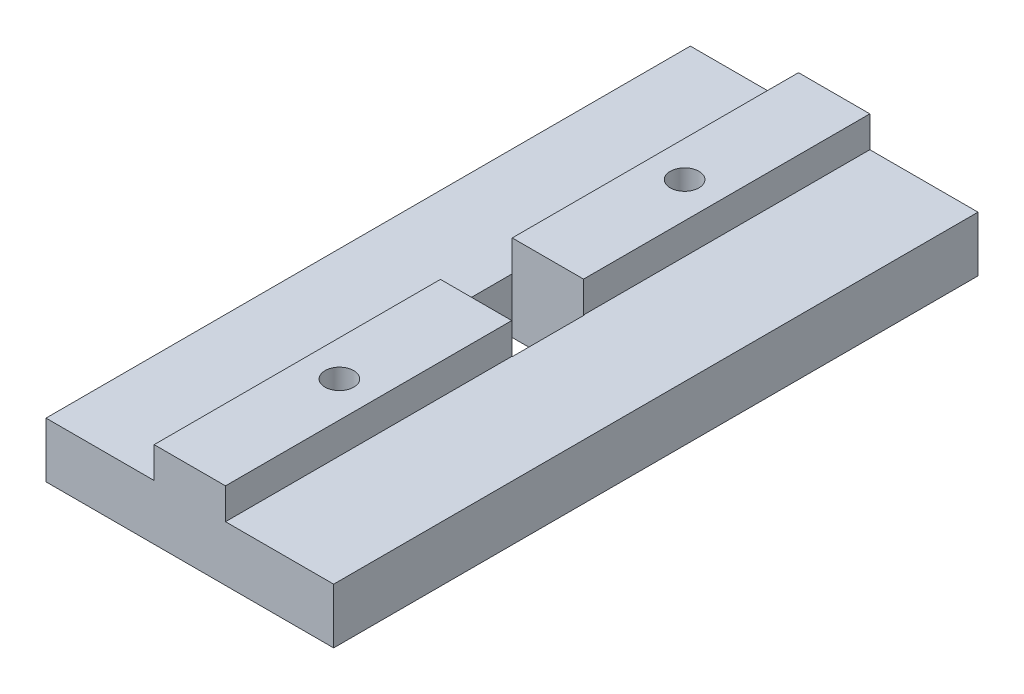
ISO-10303-21;
HEADER;
FILE_DESCRIPTION(('STEP AP214'),'2;1');
FILE_NAME('part.step','',(''),(''),'','','');
FILE_SCHEMA(('AUTOMOTIVE_DESIGN { 1 0 10303 214 1 1 1 1 }'));
ENDSEC;
DATA;
#1=APPLICATION_CONTEXT('core data for automotive mechanical design processes');
#2=APPLICATION_PROTOCOL_DEFINITION('international standard','automotive_design',2000,#1);
#3=PRODUCT_CONTEXT('',#1,'mechanical');
#4=PRODUCT('Part','Part','',(#3));
#5=PRODUCT_RELATED_PRODUCT_CATEGORY('part','',(#4));
#6=PRODUCT_DEFINITION_FORMATION('','',#4);
#7=PRODUCT_DEFINITION_CONTEXT('part definition',#1,'design');
#8=PRODUCT_DEFINITION('design','',#6,#7);
#9=PRODUCT_DEFINITION_SHAPE('','',#8);
#10=(LENGTH_UNIT() NAMED_UNIT(*) SI_UNIT(.MILLI.,.METRE.));
#11=(NAMED_UNIT(*) PLANE_ANGLE_UNIT() SI_UNIT($,.RADIAN.));
#12=(NAMED_UNIT(*) SI_UNIT($,.STERADIAN.) SOLID_ANGLE_UNIT());
#13=UNCERTAINTY_MEASURE_WITH_UNIT(LENGTH_MEASURE(1.E-05),#10,'distance_accuracy_value','');
#14=(GEOMETRIC_REPRESENTATION_CONTEXT(3) GLOBAL_UNCERTAINTY_ASSIGNED_CONTEXT((#13)) GLOBAL_UNIT_ASSIGNED_CONTEXT((#10,
#11,#12)) REPRESENTATION_CONTEXT('',''));
#15=CARTESIAN_POINT('',(0.,0.,0.));
#16=DIRECTION('',(0.,0.,1.));
#17=DIRECTION('',(1.,0.,0.));
#18=AXIS2_PLACEMENT_3D('',#15,#16,#17);
#19=CARTESIAN_POINT('',(-7.07558553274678,-11.3128787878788,71.12));
#20=DIRECTION('',(-1.,0.,0.));
#21=DIRECTION('',(0.,-1.,0.));
#22=AXIS2_PLACEMENT_3D('',#19,#20,#21);
#23=PLANE('',#22);
#24=DIRECTION('',(0.,0.,-1.));
#25=VECTOR('',#24,1.);
#26=CARTESIAN_POINT('',(-7.07558553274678,-11.3128787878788,71.12));
#27=LINE('',#26,#25);
#28=CARTESIAN_POINT('',(-7.07558553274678,-11.3128787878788,31.5976));
#29=VERTEX_POINT('',#28);
#30=CARTESIAN_POINT('',(-7.07558553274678,-11.3128787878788,0.));
#31=VERTEX_POINT('',#30);
#32=EDGE_CURVE('E230',#29,#31,#27,.T.);
#33=ORIENTED_EDGE('',*,*,#32,.F.);
#34=DIRECTION('',(0.,-1.,0.));
#35=VECTOR('',#34,1.);
#36=CARTESIAN_POINT('',(-7.07558553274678,-11.3128787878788,31.5976));
#37=LINE('',#36,#35);
#38=CARTESIAN_POINT('',(-7.07558553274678,-14.7418787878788,31.5976));
#39=VERTEX_POINT('',#38);
#40=EDGE_CURVE('E169',#29,#39,#37,.T.);
#41=ORIENTED_EDGE('',*,*,#40,.T.);
#42=DIRECTION('',(0.,0.,-1.));
#43=VECTOR('',#42,1.);
#44=CARTESIAN_POINT('',(-7.07558553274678,-14.7418787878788,71.12));
#45=LINE('',#44,#43);
#46=CARTESIAN_POINT('',(-7.07558553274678,-14.7418787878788,0.));
#47=VERTEX_POINT('',#46);
#48=EDGE_CURVE('E234',#39,#47,#45,.T.);
#49=ORIENTED_EDGE('',*,*,#48,.T.);
#50=DIRECTION('',(0.,1.,0.));
#51=VECTOR('',#50,1.);
#52=CARTESIAN_POINT('',(-7.07558553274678,-11.3128787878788,0.));
#53=LINE('',#52,#51);
#54=EDGE_CURVE('E210',#47,#31,#53,.T.);
#55=ORIENTED_EDGE('',*,*,#54,.T.);
#56=EDGE_LOOP('',(#33,#41,#49,#55));
#57=FACE_BOUND('',#56,.T.);
#58=ADVANCED_FACE('F17',(#57),#23,.F.);
#59=CARTESIAN_POINT('',(-14.9495855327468,-11.3128787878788,71.12));
#60=DIRECTION('',(0.,-1.,0.));
#61=DIRECTION('',(0.,0.,-1.));
#62=AXIS2_PLACEMENT_3D('',#59,#60,#61);
#63=PLANE('',#62);
#64=CARTESIAN_POINT('',(-11.0125855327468,-11.3128787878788,16.51));
#65=DIRECTION('',(0.,1.,0.));
#66=DIRECTION('',(0.,0.,1.));
#67=AXIS2_PLACEMENT_3D('',#64,#65,#66);
#68=CIRCLE('',#67,1.5875);
#69=CARTESIAN_POINT('',(-11.0125855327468,-11.3128787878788,18.0975));
#70=VERTEX_POINT('',#69);
#71=EDGE_CURVE('E150',#70,#70,#68,.T.);
#72=ORIENTED_EDGE('',*,*,#71,.F.);
#73=EDGE_LOOP('',(#72));
#74=FACE_BOUND('',#73,.T.);
#75=DIRECTION('',(0.,0.,-1.));
#76=VECTOR('',#75,1.);
#77=CARTESIAN_POINT('',(-14.9495855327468,-11.3128787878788,71.12));
#78=LINE('',#77,#76);
#79=CARTESIAN_POINT('',(-14.9495855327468,-11.3128787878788,31.5976));
#80=VERTEX_POINT('',#79);
#81=CARTESIAN_POINT('',(-14.9495855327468,-11.3128787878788,0.));
#82=VERTEX_POINT('',#81);
#83=EDGE_CURVE('E226',#80,#82,#78,.T.);
#84=ORIENTED_EDGE('',*,*,#83,.F.);
#85=DIRECTION('',(-1.,0.,0.));
#86=VECTOR('',#85,1.);
#87=CARTESIAN_POINT('',(-14.9495855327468,-11.3128787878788,31.5976));
#88=LINE('',#87,#86);
#89=EDGE_CURVE('E145',#29,#80,#88,.T.);
#90=ORIENTED_EDGE('',*,*,#89,.F.);
#91=ORIENTED_EDGE('',*,*,#32,.T.);
#92=DIRECTION('',(-1.,0.,0.));
#93=VECTOR('',#92,1.);
#94=CARTESIAN_POINT('',(-14.9495855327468,-11.3128787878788,0.));
#95=LINE('',#94,#93);
#96=EDGE_CURVE('E213',#31,#82,#95,.T.);
#97=ORIENTED_EDGE('',*,*,#96,.T.);
#98=EDGE_LOOP('',(#84,#90,#91,#97));
#99=FACE_BOUND('',#98,.T.);
#100=ADVANCED_FACE('F283',(#74,#99),#63,.F.);
#101=CARTESIAN_POINT('',(-14.9495855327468,-14.7418787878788,71.12));
#102=DIRECTION('',(1.,0.,0.));
#103=DIRECTION('',(0.,1.,0.));
#104=AXIS2_PLACEMENT_3D('',#101,#102,#103);
#105=PLANE('',#104);
#106=DIRECTION('',(0.,0.,-1.));
#107=VECTOR('',#106,1.);
#108=CARTESIAN_POINT('',(-14.9495855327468,-14.7418787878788,71.12));
#109=LINE('',#108,#107);
#110=CARTESIAN_POINT('',(-14.9495855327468,-14.7418787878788,31.5976));
#111=VERTEX_POINT('',#110);
#112=CARTESIAN_POINT('',(-14.9495855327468,-14.7418787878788,0.));
#113=VERTEX_POINT('',#112);
#114=EDGE_CURVE('E222',#111,#113,#109,.T.);
#115=ORIENTED_EDGE('',*,*,#114,.F.);
#116=DIRECTION('',(0.,1.,0.));
#117=VECTOR('',#116,1.);
#118=CARTESIAN_POINT('',(-14.9495855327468,-20.8378787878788,31.5976));
#119=LINE('',#118,#117);
#120=EDGE_CURVE('E159',#111,#80,#119,.T.);
#121=ORIENTED_EDGE('',*,*,#120,.T.);
#122=ORIENTED_EDGE('',*,*,#83,.T.);
#123=DIRECTION('',(0.,-1.,0.));
#124=VECTOR('',#123,1.);
#125=CARTESIAN_POINT('',(-14.9495855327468,-14.7418787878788,0.));
#126=LINE('',#125,#124);
#127=EDGE_CURVE('E216',#82,#113,#126,.T.);
#128=ORIENTED_EDGE('',*,*,#127,.T.);
#129=EDGE_LOOP('',(#115,#121,#122,#128));
#130=FACE_BOUND('',#129,.T.);
#131=ADVANCED_FACE('F279',(#130),#105,.F.);
#132=CARTESIAN_POINT('',(-26.8875855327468,-14.7418787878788,71.12));
#133=DIRECTION('',(1.,0.,0.));
#134=DIRECTION('',(0.,0.,-1.));
#135=AXIS2_PLACEMENT_3D('',#132,#133,#134);
#136=PLANE('',#135);
#137=DIRECTION('',(0.,-1.,0.));
#138=VECTOR('',#137,1.);
#139=CARTESIAN_POINT('',(-26.8875855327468,-14.7418787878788,0.));
#140=LINE('',#139,#138);
#141=CARTESIAN_POINT('',(-26.8875855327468,-14.7418787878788,0.));
#142=VERTEX_POINT('',#141);
#143=CARTESIAN_POINT('',(-26.8875855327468,-20.8378787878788,0.));
#144=VERTEX_POINT('',#143);
#145=EDGE_CURVE('E179',#142,#144,#140,.T.);
#146=ORIENTED_EDGE('',*,*,#145,.T.);
#147=DIRECTION('',(0.,0.,-1.));
#148=VECTOR('',#147,1.);
#149=CARTESIAN_POINT('',(-26.8875855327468,-20.8378787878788,71.12));
#150=LINE('',#149,#148);
#151=CARTESIAN_POINT('',(-26.8875855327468,-20.8378787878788,71.12));
#152=VERTEX_POINT('',#151);
#153=EDGE_CURVE('E25',#152,#144,#150,.T.);
#154=ORIENTED_EDGE('',*,*,#153,.F.);
#155=DIRECTION('',(0.,-1.,0.));
#156=VECTOR('',#155,1.);
#157=CARTESIAN_POINT('',(-26.8875855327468,-14.7418787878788,71.12));
#158=LINE('',#157,#156);
#159=CARTESIAN_POINT('',(-26.8875855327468,-14.7418787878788,71.12));
#160=VERTEX_POINT('',#159);
#161=EDGE_CURVE('E182',#160,#152,#158,.T.);
#162=ORIENTED_EDGE('',*,*,#161,.F.);
#163=DIRECTION('',(0.,0.,-1.));
#164=VECTOR('',#163,1.);
#165=CARTESIAN_POINT('',(-26.8875855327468,-14.7418787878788,71.12));
#166=LINE('',#165,#164);
#167=EDGE_CURVE('E200',#160,#142,#166,.T.);
#168=ORIENTED_EDGE('',*,*,#167,.T.);
#169=EDGE_LOOP('',(#146,#154,#162,#168));
#170=FACE_BOUND('',#169,.T.);
#171=ADVANCED_FACE('F19',(#170),#136,.F.);
#172=CARTESIAN_POINT('',(-26.8875855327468,-20.8378787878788,71.12));
#173=DIRECTION('',(0.,1.,0.));
#174=DIRECTION('',(0.,0.,1.));
#175=AXIS2_PLACEMENT_3D('',#172,#173,#174);
#176=PLANE('',#175);
#177=CARTESIAN_POINT('',(-11.0125855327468,-20.8378787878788,16.51));
#178=DIRECTION('',(0.,1.,0.));
#179=DIRECTION('',(0.,0.,1.));
#180=AXIS2_PLACEMENT_3D('',#177,#178,#179);
#181=CIRCLE('',#180,1.5875);
#182=CARTESIAN_POINT('',(-11.0125855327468,-20.8378787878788,18.0975));
#183=VERTEX_POINT('',#182);
#184=EDGE_CURVE('E155',#183,#183,#181,.T.);
#185=ORIENTED_EDGE('',*,*,#184,.T.);
#186=EDGE_LOOP('',(#185));
#187=FACE_BOUND('',#186,.T.);
#188=DIRECTION('',(-1.,0.,0.));
#189=VECTOR('',#188,1.);
#190=CARTESIAN_POINT('',(-14.9495855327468,-20.8378787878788,31.5976));
#191=LINE('',#190,#189);
#192=CARTESIAN_POINT('',(-7.02478553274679,-20.8378787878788,31.5976));
#193=VERTEX_POINT('',#192);
#194=CARTESIAN_POINT('',(-14.9495855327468,-20.8378787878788,31.5976));
#195=VERTEX_POINT('',#194);
#196=EDGE_CURVE('E144',#193,#195,#191,.T.);
#197=ORIENTED_EDGE('',*,*,#196,.T.);
#198=DIRECTION('',(0.,0.,1.));
#199=VECTOR('',#198,1.);
#200=CARTESIAN_POINT('',(-14.9495855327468,-20.8378787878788,31.5976));
#201=LINE('',#200,#199);
#202=CARTESIAN_POINT('',(-14.9495855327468,-20.8378787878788,39.5224));
#203=VERTEX_POINT('',#202);
#204=EDGE_CURVE('E127',#195,#203,#201,.T.);
#205=ORIENTED_EDGE('',*,*,#204,.T.);
#206=DIRECTION('',(1.,0.,0.));
#207=VECTOR('',#206,1.);
#208=CARTESIAN_POINT('',(-14.9495855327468,-20.8378787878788,39.5224));
#209=LINE('',#208,#207);
#210=CARTESIAN_POINT('',(-7.02478553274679,-20.8378787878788,39.5224));
#211=VERTEX_POINT('',#210);
#212=EDGE_CURVE('E137',#203,#211,#209,.T.);
#213=ORIENTED_EDGE('',*,*,#212,.T.);
#214=DIRECTION('',(0.,0.,-1.));
#215=VECTOR('',#214,1.);
#216=CARTESIAN_POINT('',(-7.02478553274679,-20.8378787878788,31.5976));
#217=LINE('',#216,#215);
#218=EDGE_CURVE('E32',#211,#193,#217,.T.);
#219=ORIENTED_EDGE('',*,*,#218,.T.);
#220=EDGE_LOOP('',(#197,#205,#213,#219));
#221=FACE_BOUND('',#220,.T.);
#222=CARTESIAN_POINT('',(-11.0125855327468,-20.8378787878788,54.61));
#223=DIRECTION('',(0.,1.,0.));
#224=DIRECTION('',(0.,0.,1.));
#225=AXIS2_PLACEMENT_3D('',#222,#223,#224);
#226=CIRCLE('',#225,1.5875);
#227=CARTESIAN_POINT('',(-11.0125855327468,-20.8378787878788,56.1975));
#228=VERTEX_POINT('',#227);
#229=EDGE_CURVE('E176',#228,#228,#226,.T.);
#230=ORIENTED_EDGE('',*,*,#229,.T.);
#231=EDGE_LOOP('',(#230));
#232=FACE_BOUND('',#231,.T.);
#233=DIRECTION('',(1.,0.,0.));
#234=VECTOR('',#233,1.);
#235=CARTESIAN_POINT('',(-26.8875855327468,-20.8378787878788,0.));
#236=LINE('',#235,#234);
#237=CARTESIAN_POINT('',(4.86241446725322,-20.8378787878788,0.));
#238=VERTEX_POINT('',#237);
#239=EDGE_CURVE('E203',#144,#238,#236,.T.);
#240=ORIENTED_EDGE('',*,*,#239,.T.);
#241=DIRECTION('',(0.,0.,-1.));
#242=VECTOR('',#241,1.);
#243=CARTESIAN_POINT('',(4.86241446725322,-20.8378787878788,71.12));
#244=LINE('',#243,#242);
#245=CARTESIAN_POINT('',(4.86241446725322,-20.8378787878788,71.12));
#246=VERTEX_POINT('',#245);
#247=EDGE_CURVE('E241',#246,#238,#244,.T.);
#248=ORIENTED_EDGE('',*,*,#247,.F.);
#249=DIRECTION('',(1.,0.,0.));
#250=VECTOR('',#249,1.);
#251=CARTESIAN_POINT('',(-26.8875855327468,-20.8378787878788,71.12));
#252=LINE('',#251,#250);
#253=EDGE_CURVE('E185',#152,#246,#252,.T.);
#254=ORIENTED_EDGE('',*,*,#253,.F.);
#255=ORIENTED_EDGE('',*,*,#153,.T.);
#256=EDGE_LOOP('',(#240,#248,#254,#255));
#257=FACE_BOUND('',#256,.T.);
#258=ADVANCED_FACE('F141',(#187,#221,#232,#257),#176,.F.);
#259=CARTESIAN_POINT('',(4.86241446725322,-14.7418787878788,71.12));
#260=DIRECTION('',(-1.,0.,0.));
#261=DIRECTION('',(0.,0.,1.));
#262=AXIS2_PLACEMENT_3D('',#259,#260,#261);
#263=PLANE('',#262);
#264=DIRECTION('',(0.,1.,0.));
#265=VECTOR('',#264,1.);
#266=CARTESIAN_POINT('',(4.86241446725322,-14.7418787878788,0.));
#267=LINE('',#266,#265);
#268=CARTESIAN_POINT('',(4.86241446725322,-14.7418787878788,0.));
#269=VERTEX_POINT('',#268);
#270=EDGE_CURVE('E205',#238,#269,#267,.T.);
#271=ORIENTED_EDGE('',*,*,#270,.T.);
#272=DIRECTION('',(0.,0.,-1.));
#273=VECTOR('',#272,1.);
#274=CARTESIAN_POINT('',(4.86241446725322,-14.7418787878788,71.12));
#275=LINE('',#274,#273);
#276=CARTESIAN_POINT('',(4.86241446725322,-14.7418787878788,71.12));
#277=VERTEX_POINT('',#276);
#278=EDGE_CURVE('E238',#277,#269,#275,.T.);
#279=ORIENTED_EDGE('',*,*,#278,.F.);
#280=DIRECTION('',(0.,1.,0.));
#281=VECTOR('',#280,1.);
#282=CARTESIAN_POINT('',(4.86241446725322,-14.7418787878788,71.12));
#283=LINE('',#282,#281);
#284=EDGE_CURVE('E188',#246,#277,#283,.T.);
#285=ORIENTED_EDGE('',*,*,#284,.F.);
#286=ORIENTED_EDGE('',*,*,#247,.T.);
#287=EDGE_LOOP('',(#271,#279,#285,#286));
#288=FACE_BOUND('',#287,.T.);
#289=ADVANCED_FACE('F260',(#288),#263,.F.);
#290=CARTESIAN_POINT('',(-7.07558553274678,-14.7418787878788,71.12));
#291=DIRECTION('',(0.,-1.,0.));
#292=DIRECTION('',(0.,0.,-1.));
#293=AXIS2_PLACEMENT_3D('',#290,#291,#292);
#294=PLANE('',#293);
#295=ORIENTED_EDGE('',*,*,#48,.F.);
#296=DIRECTION('',(1.,0.,0.));
#297=VECTOR('',#296,1.);
#298=CARTESIAN_POINT('',(-7.07558553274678,-14.7418787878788,31.5976));
#299=LINE('',#298,#297);
#300=CARTESIAN_POINT('',(-7.02478553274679,-14.7418787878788,31.5976));
#301=VERTEX_POINT('',#300);
#302=EDGE_CURVE('E172',#39,#301,#299,.T.);
#303=ORIENTED_EDGE('',*,*,#302,.T.);
#304=DIRECTION('',(0.,0.,1.));
#305=VECTOR('',#304,1.);
#306=CARTESIAN_POINT('',(-7.02478553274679,-14.7418787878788,71.12));
#307=LINE('',#306,#305);
#308=CARTESIAN_POINT('',(-7.02478553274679,-14.7418787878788,39.5224));
#309=VERTEX_POINT('',#308);
#310=EDGE_CURVE('E11',#301,#309,#307,.T.);
#311=ORIENTED_EDGE('',*,*,#310,.T.);
#312=DIRECTION('',(-1.,0.,0.));
#313=VECTOR('',#312,1.);
#314=CARTESIAN_POINT('',(-7.07558553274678,-14.7418787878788,39.5224));
#315=LINE('',#314,#313);
#316=CARTESIAN_POINT('',(-7.07558553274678,-14.7418787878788,39.5224));
#317=VERTEX_POINT('',#316);
#318=EDGE_CURVE('E166',#309,#317,#315,.T.);
#319=ORIENTED_EDGE('',*,*,#318,.T.);
#320=CARTESIAN_POINT('',(-7.07558553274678,-14.7418787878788,71.12));
#321=VERTEX_POINT('',#320);
#322=EDGE_CURVE('E235',#321,#317,#45,.T.);
#323=ORIENTED_EDGE('',*,*,#322,.F.);
#324=DIRECTION('',(-1.,0.,0.));
#325=VECTOR('',#324,1.);
#326=CARTESIAN_POINT('',(-7.07558553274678,-14.7418787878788,71.12));
#327=LINE('',#326,#325);
#328=EDGE_CURVE('E190',#277,#321,#327,.T.);
#329=ORIENTED_EDGE('',*,*,#328,.F.);
#330=ORIENTED_EDGE('',*,*,#278,.T.);
#331=DIRECTION('',(-1.,0.,0.));
#332=VECTOR('',#331,1.);
#333=CARTESIAN_POINT('',(-7.07558553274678,-14.7418787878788,0.));
#334=LINE('',#333,#332);
#335=EDGE_CURVE('E207',#269,#47,#334,.T.);
#336=ORIENTED_EDGE('',*,*,#335,.T.);
#337=EDGE_LOOP('',(#295,#303,#311,#319,#323,#329,#330,#336));
#338=FACE_BOUND('',#337,.T.);
#339=ADVANCED_FACE('F265',(#338),#294,.F.);
#340=ORIENTED_EDGE('',*,*,#322,.T.);
#341=DIRECTION('',(0.,1.,0.));
#342=VECTOR('',#341,1.);
#343=CARTESIAN_POINT('',(-7.07558553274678,-11.3128787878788,39.5224));
#344=LINE('',#343,#342);
#345=CARTESIAN_POINT('',(-7.07558553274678,-11.3128787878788,39.5224));
#346=VERTEX_POINT('',#345);
#347=EDGE_CURVE('E158',#317,#346,#344,.T.);
#348=ORIENTED_EDGE('',*,*,#347,.T.);
#349=CARTESIAN_POINT('',(-7.07558553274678,-11.3128787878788,71.12));
#350=VERTEX_POINT('',#349);
#351=EDGE_CURVE('E231',#350,#346,#27,.T.);
#352=ORIENTED_EDGE('',*,*,#351,.F.);
#353=DIRECTION('',(0.,1.,0.));
#354=VECTOR('',#353,1.);
#355=CARTESIAN_POINT('',(-7.07558553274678,-11.3128787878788,71.12));
#356=LINE('',#355,#354);
#357=EDGE_CURVE('E192',#321,#350,#356,.T.);
#358=ORIENTED_EDGE('',*,*,#357,.F.);
#359=EDGE_LOOP('',(#340,#348,#352,#358));
#360=FACE_BOUND('',#359,.T.);
#361=ADVANCED_FACE('F305',(#360),#23,.F.);
#362=CARTESIAN_POINT('',(-11.0125855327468,-11.3128787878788,54.61));
#363=DIRECTION('',(0.,1.,0.));
#364=DIRECTION('',(0.,0.,1.));
#365=AXIS2_PLACEMENT_3D('',#362,#363,#364);
#366=CIRCLE('',#365,1.5875);
#367=CARTESIAN_POINT('',(-11.0125855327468,-11.3128787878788,56.1975));
#368=VERTEX_POINT('',#367);
#369=EDGE_CURVE('E175',#368,#368,#366,.T.);
#370=ORIENTED_EDGE('',*,*,#369,.F.);
#371=EDGE_LOOP('',(#370));
#372=FACE_BOUND('',#371,.T.);
#373=ORIENTED_EDGE('',*,*,#351,.T.);
#374=DIRECTION('',(1.,0.,0.));
#375=VECTOR('',#374,1.);
#376=CARTESIAN_POINT('',(-14.9495855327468,-11.3128787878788,39.5224));
#377=LINE('',#376,#375);
#378=CARTESIAN_POINT('',(-14.9495855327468,-11.3128787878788,39.5224));
#379=VERTEX_POINT('',#378);
#380=EDGE_CURVE('E147',#379,#346,#377,.T.);
#381=ORIENTED_EDGE('',*,*,#380,.F.);
#382=CARTESIAN_POINT('',(-14.9495855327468,-11.3128787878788,71.12));
#383=VERTEX_POINT('',#382);
#384=EDGE_CURVE('E227',#383,#379,#78,.T.);
#385=ORIENTED_EDGE('',*,*,#384,.F.);
#386=DIRECTION('',(-1.,0.,0.));
#387=VECTOR('',#386,1.);
#388=CARTESIAN_POINT('',(-14.9495855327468,-11.3128787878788,71.12));
#389=LINE('',#388,#387);
#390=EDGE_CURVE('E194',#350,#383,#389,.T.);
#391=ORIENTED_EDGE('',*,*,#390,.F.);
#392=EDGE_LOOP('',(#373,#381,#385,#391));
#393=FACE_BOUND('',#392,.T.);
#394=ADVANCED_FACE('F312',(#372,#393),#63,.F.);
#395=ORIENTED_EDGE('',*,*,#384,.T.);
#396=DIRECTION('',(0.,1.,0.));
#397=VECTOR('',#396,1.);
#398=CARTESIAN_POINT('',(-14.9495855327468,-20.8378787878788,39.5224));
#399=LINE('',#398,#397);
#400=CARTESIAN_POINT('',(-14.9495855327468,-14.7418787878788,39.5224));
#401=VERTEX_POINT('',#400);
#402=EDGE_CURVE('E134',#401,#379,#399,.T.);
#403=ORIENTED_EDGE('',*,*,#402,.F.);
#404=CARTESIAN_POINT('',(-14.9495855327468,-14.7418787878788,71.12));
#405=VERTEX_POINT('',#404);
#406=EDGE_CURVE('E223',#405,#401,#109,.T.);
#407=ORIENTED_EDGE('',*,*,#406,.F.);
#408=DIRECTION('',(0.,-1.,0.));
#409=VECTOR('',#408,1.);
#410=CARTESIAN_POINT('',(-14.9495855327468,-14.7418787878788,71.12));
#411=LINE('',#410,#409);
#412=EDGE_CURVE('E196',#383,#405,#411,.T.);
#413=ORIENTED_EDGE('',*,*,#412,.F.);
#414=EDGE_LOOP('',(#395,#403,#407,#413));
#415=FACE_BOUND('',#414,.T.);
#416=ADVANCED_FACE('F321',(#415),#105,.F.);
#417=CARTESIAN_POINT('',(-26.8875855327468,-14.7418787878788,71.12));
#418=DIRECTION('',(0.,-1.,0.));
#419=DIRECTION('',(0.,0.,-1.));
#420=AXIS2_PLACEMENT_3D('',#417,#418,#419);
#421=PLANE('',#420);
#422=DIRECTION('',(-1.,0.,0.));
#423=VECTOR('',#422,1.);
#424=CARTESIAN_POINT('',(-26.8875855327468,-14.7418787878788,0.));
#425=LINE('',#424,#423);
#426=EDGE_CURVE('E186',#113,#142,#425,.T.);
#427=ORIENTED_EDGE('',*,*,#426,.T.);
#428=ORIENTED_EDGE('',*,*,#167,.F.);
#429=DIRECTION('',(-1.,0.,0.));
#430=VECTOR('',#429,1.);
#431=CARTESIAN_POINT('',(-26.8875855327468,-14.7418787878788,71.12));
#432=LINE('',#431,#430);
#433=EDGE_CURVE('E198',#405,#160,#432,.T.);
#434=ORIENTED_EDGE('',*,*,#433,.F.);
#435=ORIENTED_EDGE('',*,*,#406,.T.);
#436=EDGE_CURVE('E130',#401,#111,#109,.T.);
#437=ORIENTED_EDGE('',*,*,#436,.T.);
#438=ORIENTED_EDGE('',*,*,#114,.T.);
#439=EDGE_LOOP('',(#427,#428,#434,#435,#437,#438));
#440=FACE_BOUND('',#439,.T.);
#441=ADVANCED_FACE('F275',(#440),#421,.F.);
#442=CARTESIAN_POINT('',(-26.8875855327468,-20.8378787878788,71.12));
#443=DIRECTION('',(0.,0.,1.));
#444=DIRECTION('',(1.,0.,0.));
#445=AXIS2_PLACEMENT_3D('',#442,#443,#444);
#446=PLANE('',#445);
#447=ORIENTED_EDGE('',*,*,#161,.T.);
#448=ORIENTED_EDGE('',*,*,#253,.T.);
#449=ORIENTED_EDGE('',*,*,#284,.T.);
#450=ORIENTED_EDGE('',*,*,#328,.T.);
#451=ORIENTED_EDGE('',*,*,#357,.T.);
#452=ORIENTED_EDGE('',*,*,#390,.T.);
#453=ORIENTED_EDGE('',*,*,#412,.T.);
#454=ORIENTED_EDGE('',*,*,#433,.T.);
#455=EDGE_LOOP('',(#447,#448,#449,#450,#451,#452,#453,#454));
#456=FACE_BOUND('',#455,.T.);
#457=ADVANCED_FACE('F269',(#456),#446,.T.);
#458=CARTESIAN_POINT('',(-26.8875855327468,-20.8378787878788,0.));
#459=DIRECTION('',(0.,0.,1.));
#460=DIRECTION('',(1.,0.,0.));
#461=AXIS2_PLACEMENT_3D('',#458,#459,#460);
#462=PLANE('',#461);
#463=ORIENTED_EDGE('',*,*,#145,.F.);
#464=ORIENTED_EDGE('',*,*,#426,.F.);
#465=ORIENTED_EDGE('',*,*,#127,.F.);
#466=ORIENTED_EDGE('',*,*,#96,.F.);
#467=ORIENTED_EDGE('',*,*,#54,.F.);
#468=ORIENTED_EDGE('',*,*,#335,.F.);
#469=ORIENTED_EDGE('',*,*,#270,.F.);
#470=ORIENTED_EDGE('',*,*,#239,.F.);
#471=EDGE_LOOP('',(#463,#464,#465,#466,#467,#468,#469,#470));
#472=FACE_BOUND('',#471,.T.);
#473=ADVANCED_FACE('F253',(#472),#462,.F.);
#474=CARTESIAN_POINT('',(-11.0125855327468,-20.8378787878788,54.61));
#475=DIRECTION('',(0.,1.,0.));
#476=DIRECTION('',(0.,0.,1.));
#477=AXIS2_PLACEMENT_3D('',#474,#475,#476);
#478=CYLINDRICAL_SURFACE('',#477,1.5875);
#479=ORIENTED_EDGE('',*,*,#229,.F.);
#480=EDGE_LOOP('',(#479));
#481=FACE_BOUND('',#480,.T.);
#482=ORIENTED_EDGE('',*,*,#369,.T.);
#483=EDGE_LOOP('',(#482));
#484=FACE_BOUND('',#483,.T.);
#485=ADVANCED_FACE('F291',(#481,#484),#478,.F.);
#486=CARTESIAN_POINT('',(-7.02478553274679,-20.8378787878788,31.5976));
#487=DIRECTION('',(1.,0.,0.));
#488=DIRECTION('',(0.,0.,-1.));
#489=AXIS2_PLACEMENT_3D('',#486,#487,#488);
#490=PLANE('',#489);
#491=DIRECTION('',(0.,1.,0.));
#492=VECTOR('',#491,1.);
#493=CARTESIAN_POINT('',(-7.02478553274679,-20.8378787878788,31.5976));
#494=LINE('',#493,#492);
#495=EDGE_CURVE('E160',#193,#301,#494,.T.);
#496=ORIENTED_EDGE('',*,*,#495,.F.);
#497=ORIENTED_EDGE('',*,*,#218,.F.);
#498=DIRECTION('',(0.,1.,0.));
#499=VECTOR('',#498,1.);
#500=CARTESIAN_POINT('',(-7.02478553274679,-20.8378787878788,39.5224));
#501=LINE('',#500,#499);
#502=EDGE_CURVE('E133',#211,#309,#501,.T.);
#503=ORIENTED_EDGE('',*,*,#502,.T.);
#504=ORIENTED_EDGE('',*,*,#310,.F.);
#505=EDGE_LOOP('',(#496,#497,#503,#504));
#506=FACE_BOUND('',#505,.T.);
#507=ADVANCED_FACE('F289',(#506),#490,.F.);
#508=CARTESIAN_POINT('',(-14.9495855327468,-20.8378787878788,31.5976));
#509=DIRECTION('',(0.,0.,-1.));
#510=DIRECTION('',(-1.,0.,0.));
#511=AXIS2_PLACEMENT_3D('',#508,#509,#510);
#512=PLANE('',#511);
#513=ORIENTED_EDGE('',*,*,#40,.F.);
#514=ORIENTED_EDGE('',*,*,#89,.T.);
#515=ORIENTED_EDGE('',*,*,#120,.F.);
#516=EDGE_CURVE('E40',#195,#111,#119,.T.);
#517=ORIENTED_EDGE('',*,*,#516,.F.);
#518=ORIENTED_EDGE('',*,*,#196,.F.);
#519=ORIENTED_EDGE('',*,*,#495,.T.);
#520=ORIENTED_EDGE('',*,*,#302,.F.);
#521=EDGE_LOOP('',(#513,#514,#515,#517,#518,#519,#520));
#522=FACE_BOUND('',#521,.T.);
#523=ADVANCED_FACE('F288',(#522),#512,.F.);
#524=CARTESIAN_POINT('',(-14.9495855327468,-20.8378787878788,39.5224));
#525=DIRECTION('',(0.,0.,1.));
#526=DIRECTION('',(1.,0.,0.));
#527=AXIS2_PLACEMENT_3D('',#524,#525,#526);
#528=PLANE('',#527);
#529=ORIENTED_EDGE('',*,*,#502,.F.);
#530=ORIENTED_EDGE('',*,*,#212,.F.);
#531=EDGE_CURVE('E123',#203,#401,#399,.T.);
#532=ORIENTED_EDGE('',*,*,#531,.T.);
#533=ORIENTED_EDGE('',*,*,#402,.T.);
#534=ORIENTED_EDGE('',*,*,#380,.T.);
#535=ORIENTED_EDGE('',*,*,#347,.F.);
#536=ORIENTED_EDGE('',*,*,#318,.F.);
#537=EDGE_LOOP('',(#529,#530,#532,#533,#534,#535,#536));
#538=FACE_BOUND('',#537,.T.);
#539=ADVANCED_FACE('F138',(#538),#528,.F.);
#540=CARTESIAN_POINT('',(-14.9495855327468,-20.8378787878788,31.5976));
#541=DIRECTION('',(-1.,0.,0.));
#542=DIRECTION('',(0.,0.,1.));
#543=AXIS2_PLACEMENT_3D('',#540,#541,#542);
#544=PLANE('',#543);
#545=ORIENTED_EDGE('',*,*,#531,.F.);
#546=ORIENTED_EDGE('',*,*,#204,.F.);
#547=ORIENTED_EDGE('',*,*,#516,.T.);
#548=ORIENTED_EDGE('',*,*,#436,.F.);
#549=EDGE_LOOP('',(#545,#546,#547,#548));
#550=FACE_BOUND('',#549,.T.);
#551=ADVANCED_FACE('F125',(#550),#544,.F.);
#552=CARTESIAN_POINT('',(-11.0125855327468,-20.8378787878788,16.51));
#553=DIRECTION('',(0.,1.,0.));
#554=DIRECTION('',(0.,0.,1.));
#555=AXIS2_PLACEMENT_3D('',#552,#553,#554);
#556=CYLINDRICAL_SURFACE('',#555,1.5875);
#557=ORIENTED_EDGE('',*,*,#184,.F.);
#558=EDGE_LOOP('',(#557));
#559=FACE_BOUND('',#558,.T.);
#560=ORIENTED_EDGE('',*,*,#71,.T.);
#561=EDGE_LOOP('',(#560));
#562=FACE_BOUND('',#561,.T.);
#563=ADVANCED_FACE('F356',(#559,#562),#556,.F.);
#564=CLOSED_SHELL('',(#58,#100,#131,#171,#258,#289,#339,#361,#394,#416,#441,#457,#473,#485,#507,
#523,#539,#551,#563));
#565=MANIFOLD_SOLID_BREP('B1',#564);
#566=ADVANCED_BREP_SHAPE_REPRESENTATION('',(#18,#565),#14);
#567=SHAPE_DEFINITION_REPRESENTATION(#9,#566);
ENDSEC;
END-ISO-10303-21;
